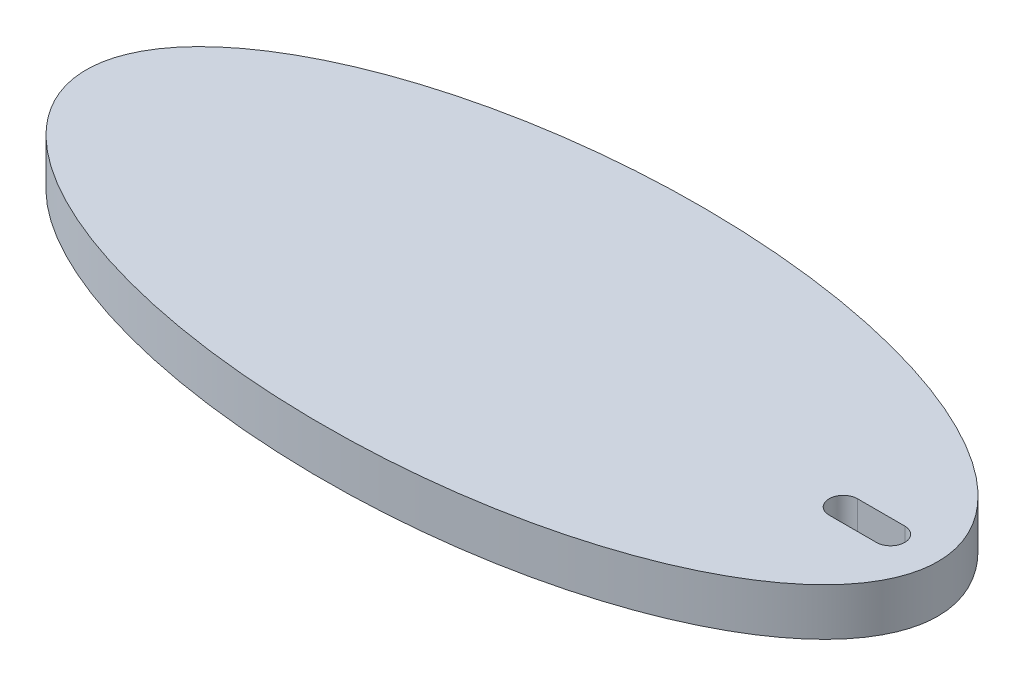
ISO-10303-21;
HEADER;
FILE_DESCRIPTION(('STEP AP214'),'2;1');
FILE_NAME('part.step','',(''),(''),'','','');
FILE_SCHEMA(('AUTOMOTIVE_DESIGN { 1 0 10303 214 1 1 1 1 }'));
ENDSEC;
DATA;
#1=APPLICATION_CONTEXT('core data for automotive mechanical design processes');
#2=APPLICATION_PROTOCOL_DEFINITION('international standard','automotive_design',2000,#1);
#3=PRODUCT_CONTEXT('',#1,'mechanical');
#4=PRODUCT('Part','Part','',(#3));
#5=PRODUCT_RELATED_PRODUCT_CATEGORY('part','',(#4));
#6=PRODUCT_DEFINITION_FORMATION('','',#4);
#7=PRODUCT_DEFINITION_CONTEXT('part definition',#1,'design');
#8=PRODUCT_DEFINITION('design','',#6,#7);
#9=PRODUCT_DEFINITION_SHAPE('','',#8);
#10=(LENGTH_UNIT() NAMED_UNIT(*) SI_UNIT(.MILLI.,.METRE.));
#11=(NAMED_UNIT(*) PLANE_ANGLE_UNIT() SI_UNIT($,.RADIAN.));
#12=(NAMED_UNIT(*) SI_UNIT($,.STERADIAN.) SOLID_ANGLE_UNIT());
#13=UNCERTAINTY_MEASURE_WITH_UNIT(LENGTH_MEASURE(1.E-05),#10,'distance_accuracy_value','');
#14=(GEOMETRIC_REPRESENTATION_CONTEXT(3) GLOBAL_UNCERTAINTY_ASSIGNED_CONTEXT((#13)) GLOBAL_UNIT_ASSIGNED_CONTEXT((#10,
#11,#12)) REPRESENTATION_CONTEXT('',''));
#15=CARTESIAN_POINT('',(0.,0.,0.));
#16=DIRECTION('',(0.,0.,1.));
#17=DIRECTION('',(1.,0.,0.));
#18=AXIS2_PLACEMENT_3D('',#15,#16,#17);
#19=CARTESIAN_POINT('',(0.,5.,0.));
#20=DIRECTION('',(0.,1.,0.));
#21=DIRECTION('',(1.,0.,0.));
#22=AXIS2_PLACEMENT_3D('',#19,#20,#21);
#23=ELLIPSE('',#22,45.,20.);
#24=DIRECTION('',(0.,-1.,0.));
#25=VECTOR('',#24,1.);
#26=SURFACE_OF_LINEAR_EXTRUSION('',#23,#25);
#27=CARTESIAN_POINT('',(45.,5.,0.));
#28=VERTEX_POINT('',#27);
#29=EDGE_CURVE('E11',#28,#28,#23,.T.);
#30=ORIENTED_EDGE('',*,*,#29,.F.);
#31=EDGE_LOOP('',(#30));
#32=FACE_BOUND('',#31,.T.);
#33=CARTESIAN_POINT('',(0.,0.,0.));
#34=DIRECTION('',(0.,1.,0.));
#35=DIRECTION('',(1.,0.,0.));
#36=AXIS2_PLACEMENT_3D('',#33,#34,#35);
#37=ELLIPSE('',#36,45.,20.);
#38=CARTESIAN_POINT('',(45.,0.,0.));
#39=VERTEX_POINT('',#38);
#40=EDGE_CURVE('E41',#39,#39,#37,.T.);
#41=ORIENTED_EDGE('',*,*,#40,.T.);
#42=EDGE_LOOP('',(#41));
#43=FACE_BOUND('',#42,.T.);
#44=ADVANCED_FACE('F33',(#32,#43),#26,.F.);
#45=CARTESIAN_POINT('',(0.,5.,0.));
#46=DIRECTION('',(0.,1.,0.));
#47=DIRECTION('',(0.,0.,1.));
#48=AXIS2_PLACEMENT_3D('',#45,#46,#47);
#49=PLANE('',#48);
#50=CARTESIAN_POINT('',(35.,5.,0.));
#51=DIRECTION('',(0.,1.,0.));
#52=DIRECTION('',(0.,0.,-1.));
#53=AXIS2_PLACEMENT_3D('',#50,#51,#52);
#54=CIRCLE('',#53,1.5);
#55=CARTESIAN_POINT('',(35.,5.,-1.5));
#56=VERTEX_POINT('',#55);
#57=CARTESIAN_POINT('',(35.,5.,1.5));
#58=VERTEX_POINT('',#57);
#59=EDGE_CURVE('E48',#56,#58,#54,.T.);
#60=ORIENTED_EDGE('',*,*,#59,.F.);
#61=DIRECTION('',(-1.,0.,0.));
#62=VECTOR('',#61,1.);
#63=CARTESIAN_POINT('',(35.,5.,-1.5));
#64=LINE('',#63,#62);
#65=CARTESIAN_POINT('',(40.,5.,-1.5));
#66=VERTEX_POINT('',#65);
#67=EDGE_CURVE('E92',#66,#56,#64,.T.);
#68=ORIENTED_EDGE('',*,*,#67,.F.);
#69=CARTESIAN_POINT('',(40.,5.,0.));
#70=DIRECTION('',(0.,1.,0.));
#71=DIRECTION('',(0.,0.,-1.));
#72=AXIS2_PLACEMENT_3D('',#69,#70,#71);
#73=CIRCLE('',#72,1.5);
#74=CARTESIAN_POINT('',(40.,5.,1.5));
#75=VERTEX_POINT('',#74);
#76=EDGE_CURVE('E76',#75,#66,#73,.T.);
#77=ORIENTED_EDGE('',*,*,#76,.F.);
#78=DIRECTION('',(1.,0.,0.));
#79=VECTOR('',#78,1.);
#80=CARTESIAN_POINT('',(40.,5.,1.5));
#81=LINE('',#80,#79);
#82=EDGE_CURVE('E85',#58,#75,#81,.T.);
#83=ORIENTED_EDGE('',*,*,#82,.F.);
#84=EDGE_LOOP('',(#60,#68,#77,#83));
#85=FACE_BOUND('',#84,.T.);
#86=ORIENTED_EDGE('',*,*,#29,.T.);
#87=EDGE_LOOP('',(#86));
#88=FACE_BOUND('',#87,.T.);
#89=ADVANCED_FACE('F89',(#85,#88),#49,.T.);
#90=CARTESIAN_POINT('',(0.,0.,0.));
#91=DIRECTION('',(0.,1.,0.));
#92=DIRECTION('',(0.,0.,1.));
#93=AXIS2_PLACEMENT_3D('',#90,#91,#92);
#94=PLANE('',#93);
#95=DIRECTION('',(-1.,0.,0.));
#96=VECTOR('',#95,1.);
#97=CARTESIAN_POINT('',(35.,0.,-1.5));
#98=LINE('',#97,#96);
#99=CARTESIAN_POINT('',(40.,0.,-1.5));
#100=VERTEX_POINT('',#99);
#101=CARTESIAN_POINT('',(35.,0.,-1.5));
#102=VERTEX_POINT('',#101);
#103=EDGE_CURVE('E103',#100,#102,#98,.T.);
#104=ORIENTED_EDGE('',*,*,#103,.T.);
#105=CARTESIAN_POINT('',(35.,0.,0.));
#106=DIRECTION('',(0.,1.,0.));
#107=DIRECTION('',(0.,0.,-1.));
#108=AXIS2_PLACEMENT_3D('',#105,#106,#107);
#109=CIRCLE('',#108,1.5);
#110=CARTESIAN_POINT('',(35.,0.,1.5));
#111=VERTEX_POINT('',#110);
#112=EDGE_CURVE('E94',#102,#111,#109,.T.);
#113=ORIENTED_EDGE('',*,*,#112,.T.);
#114=DIRECTION('',(1.,0.,0.));
#115=VECTOR('',#114,1.);
#116=CARTESIAN_POINT('',(40.,0.,1.5));
#117=LINE('',#116,#115);
#118=CARTESIAN_POINT('',(40.,0.,1.5));
#119=VERTEX_POINT('',#118);
#120=EDGE_CURVE('E100',#111,#119,#117,.T.);
#121=ORIENTED_EDGE('',*,*,#120,.T.);
#122=CARTESIAN_POINT('',(40.,0.,0.));
#123=DIRECTION('',(0.,1.,0.));
#124=DIRECTION('',(0.,0.,-1.));
#125=AXIS2_PLACEMENT_3D('',#122,#123,#124);
#126=CIRCLE('',#125,1.5);
#127=EDGE_CURVE('E56',#119,#100,#126,.T.);
#128=ORIENTED_EDGE('',*,*,#127,.T.);
#129=EDGE_LOOP('',(#104,#113,#121,#128));
#130=FACE_BOUND('',#129,.T.);
#131=ORIENTED_EDGE('',*,*,#40,.F.);
#132=EDGE_LOOP('',(#131));
#133=FACE_BOUND('',#132,.T.);
#134=ADVANCED_FACE('F113',(#130,#133),#94,.F.);
#135=CARTESIAN_POINT('',(35.,0.,0.));
#136=DIRECTION('',(0.,1.,0.));
#137=DIRECTION('',(0.,0.,1.));
#138=AXIS2_PLACEMENT_3D('',#135,#136,#137);
#139=CYLINDRICAL_SURFACE('',#138,1.5);
#140=ORIENTED_EDGE('',*,*,#59,.T.);
#141=DIRECTION('',(0.,1.,0.));
#142=VECTOR('',#141,1.);
#143=CARTESIAN_POINT('',(35.,0.,1.5));
#144=LINE('',#143,#142);
#145=EDGE_CURVE('E82',#111,#58,#144,.T.);
#146=ORIENTED_EDGE('',*,*,#145,.F.);
#147=ORIENTED_EDGE('',*,*,#112,.F.);
#148=DIRECTION('',(0.,1.,0.));
#149=VECTOR('',#148,1.);
#150=CARTESIAN_POINT('',(35.,0.,-1.5));
#151=LINE('',#150,#149);
#152=EDGE_CURVE('E106',#102,#56,#151,.T.);
#153=ORIENTED_EDGE('',*,*,#152,.T.);
#154=EDGE_LOOP('',(#140,#146,#147,#153));
#155=FACE_BOUND('',#154,.T.);
#156=ADVANCED_FACE('F115',(#155),#139,.F.);
#157=CARTESIAN_POINT('',(35.,0.,-1.5));
#158=DIRECTION('',(0.,0.,-1.));
#159=DIRECTION('',(-1.,0.,0.));
#160=AXIS2_PLACEMENT_3D('',#157,#158,#159);
#161=PLANE('',#160);
#162=ORIENTED_EDGE('',*,*,#67,.T.);
#163=ORIENTED_EDGE('',*,*,#152,.F.);
#164=ORIENTED_EDGE('',*,*,#103,.F.);
#165=DIRECTION('',(0.,1.,0.));
#166=VECTOR('',#165,1.);
#167=CARTESIAN_POINT('',(40.,0.,-1.5));
#168=LINE('',#167,#166);
#169=EDGE_CURVE('E81',#100,#66,#168,.T.);
#170=ORIENTED_EDGE('',*,*,#169,.T.);
#171=EDGE_LOOP('',(#162,#163,#164,#170));
#172=FACE_BOUND('',#171,.T.);
#173=ADVANCED_FACE('F122',(#172),#161,.F.);
#174=CARTESIAN_POINT('',(40.,0.,0.));
#175=DIRECTION('',(0.,1.,0.));
#176=DIRECTION('',(0.,0.,1.));
#177=AXIS2_PLACEMENT_3D('',#174,#175,#176);
#178=CYLINDRICAL_SURFACE('',#177,1.5);
#179=ORIENTED_EDGE('',*,*,#76,.T.);
#180=ORIENTED_EDGE('',*,*,#169,.F.);
#181=ORIENTED_EDGE('',*,*,#127,.F.);
#182=DIRECTION('',(0.,1.,0.));
#183=VECTOR('',#182,1.);
#184=CARTESIAN_POINT('',(40.,0.,1.5));
#185=LINE('',#184,#183);
#186=EDGE_CURVE('E72',#119,#75,#185,.T.);
#187=ORIENTED_EDGE('',*,*,#186,.T.);
#188=EDGE_LOOP('',(#179,#180,#181,#187));
#189=FACE_BOUND('',#188,.T.);
#190=ADVANCED_FACE('F74',(#189),#178,.F.);
#191=CARTESIAN_POINT('',(40.,0.,1.5));
#192=DIRECTION('',(0.,0.,1.));
#193=DIRECTION('',(1.,0.,0.));
#194=AXIS2_PLACEMENT_3D('',#191,#192,#193);
#195=PLANE('',#194);
#196=ORIENTED_EDGE('',*,*,#82,.T.);
#197=ORIENTED_EDGE('',*,*,#186,.F.);
#198=ORIENTED_EDGE('',*,*,#120,.F.);
#199=ORIENTED_EDGE('',*,*,#145,.T.);
#200=EDGE_LOOP('',(#196,#197,#198,#199));
#201=FACE_BOUND('',#200,.T.);
#202=ADVANCED_FACE('F86',(#201),#195,.F.);
#203=CLOSED_SHELL('',(#44,#89,#134,#156,#173,#190,#202));
#204=MANIFOLD_SOLID_BREP('B2',#203);
#205=ADVANCED_BREP_SHAPE_REPRESENTATION('',(#18,#204),#14);
#206=SHAPE_DEFINITION_REPRESENTATION(#9,#205);
ENDSEC;
END-ISO-10303-21;
